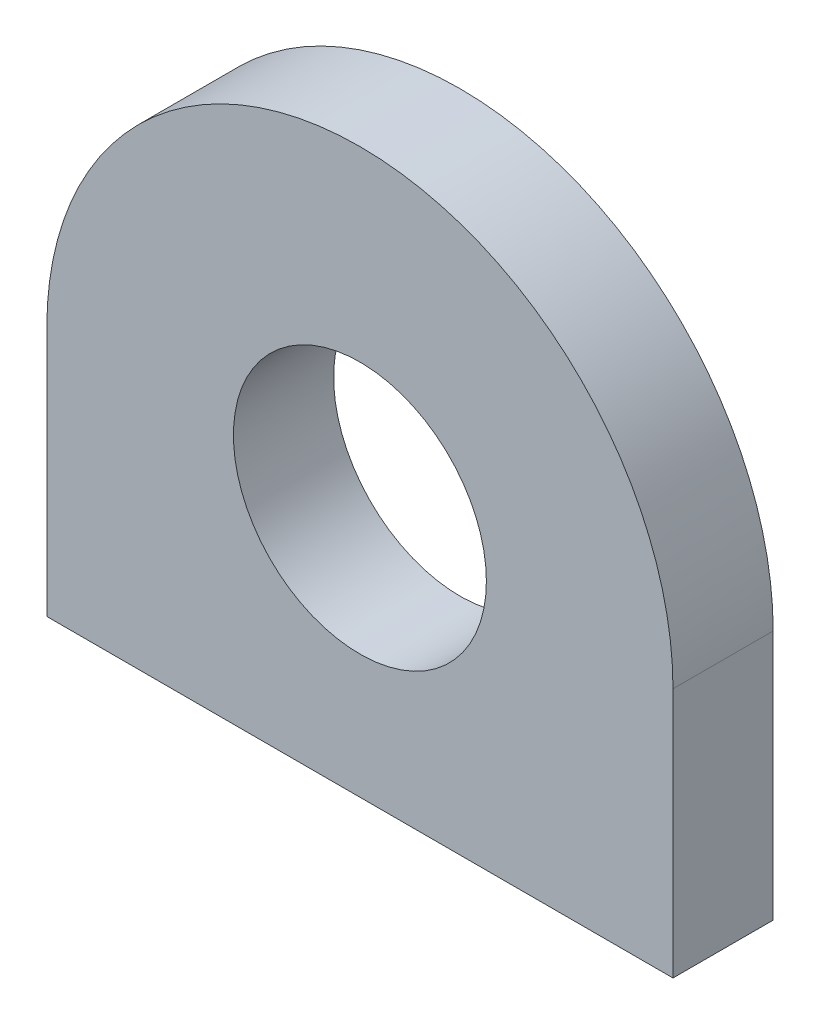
from build123d import *

# Parameters (mm, degrees)
ESQUISSE1_R      = 10.1
EXTRUSION1_DEPTH = 8


with BuildPart() as part:
    # Esquisse1 → Extrusion1 (new body)
    with BuildSketch(Plane.XY):
        with BuildLine():
            Line((-25, -20), (25, -20))
            Line((25, -20), (25, 0))
            ThreePointArc((25, 0), (0, 25), (-25, 0))
            Line((-25, 0), (-25, -20))
        make_face()
        Circle(ESQUISSE1_R, mode=Mode.SUBTRACT)
    extrude(amount=EXTRUSION1_DEPTH)


solid = part.part
